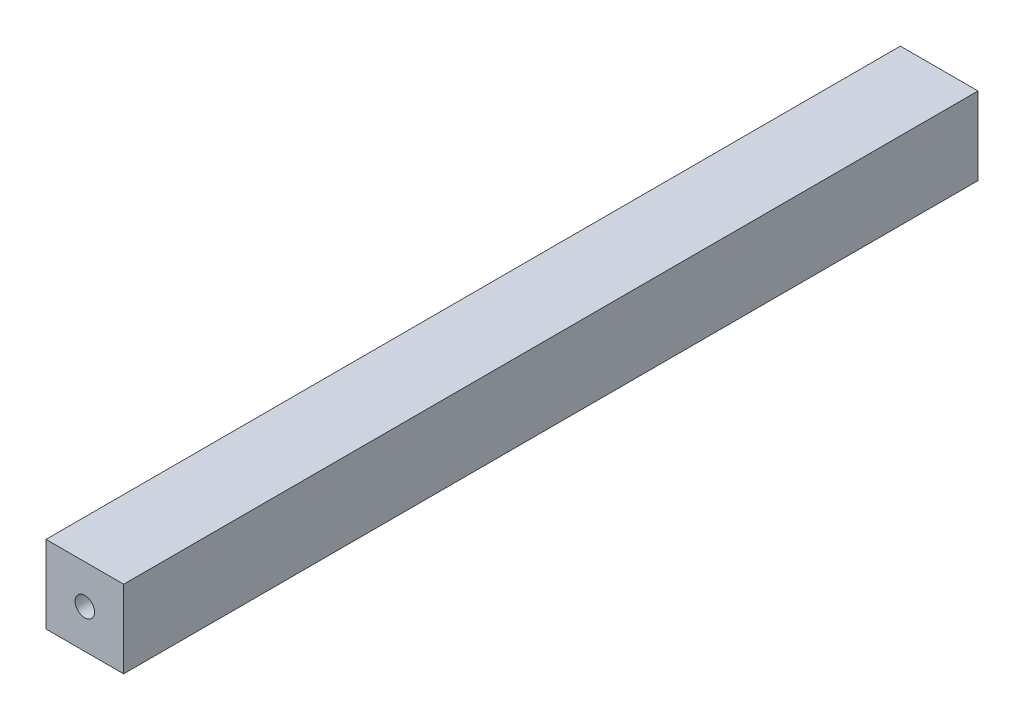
from build123d import *

# Parameters (mm, degrees)
ESQUISSE1_W          = 10
ESQUISSE1_H          = 10
ESQUISSE1_R          = 1.25
BASE_EXTRUSION_DEPTH = 110


with BuildPart() as part:
    # Esquisse1 → Base-Extrusion (new body)
    with BuildSketch(Plane.XY):
        with Locations((-17.379878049, -15)):
            Rectangle(ESQUISSE1_W, ESQUISSE1_H)
        with Locations((-17.379878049, -15)):
            Circle(ESQUISSE1_R, mode=Mode.SUBTRACT)
    extrude(amount=BASE_EXTRUSION_DEPTH)


solid = part.part
